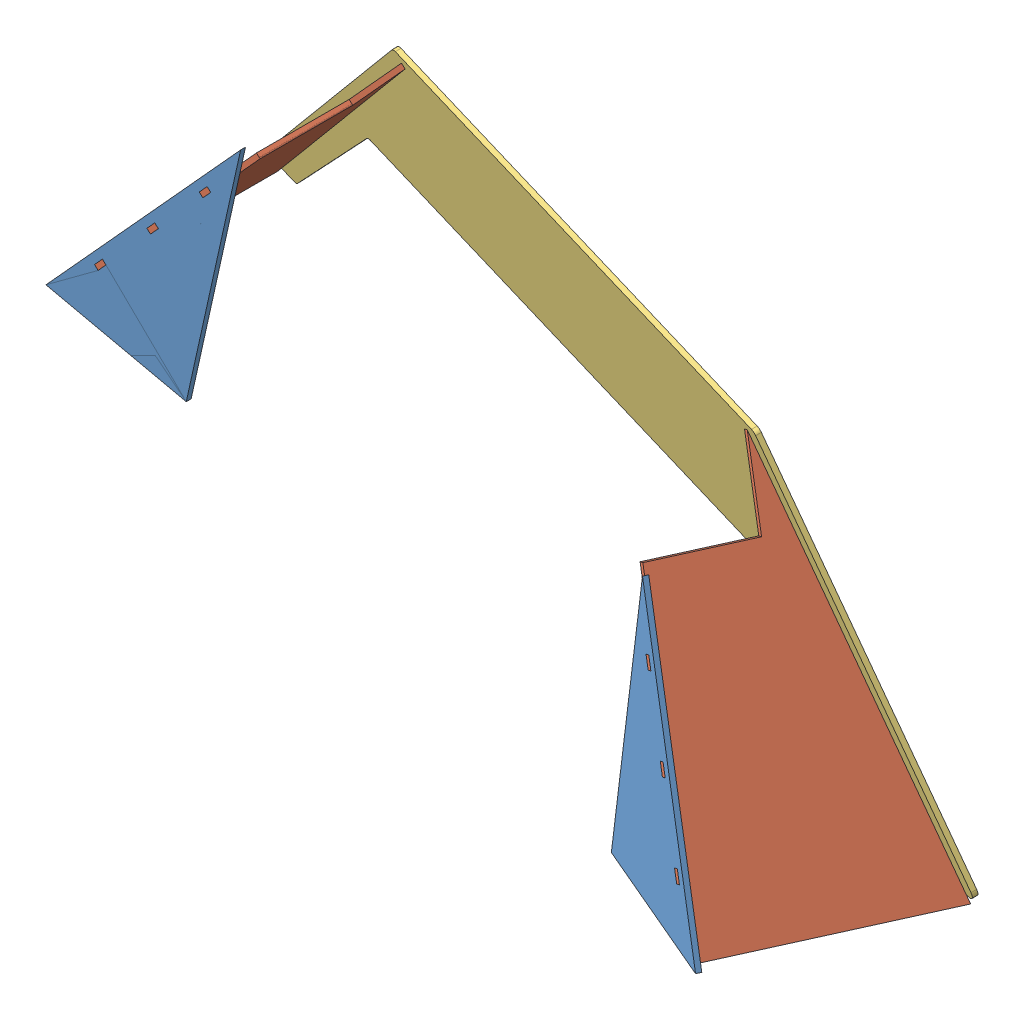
SolidWorks assembly 装配体.SLDASM, configuration Default (file format 10000). Lengths in mm.
Overall size (472.43 248.2 197.37).
7 component instances, 3 part files, 12 mates.
Components (placement in the parent):
- 三角面wzh-1: 三角面wzh.SLDPRT [默认] at (75.9658 122.0827 75.8386) x (0.095087 -0.995469 0) z (0 0 -1) size (122.75 110.01 2.5)
- 梯形碳纤维wzh-1: 梯形碳纤维wzh.SLDPRT [默认] at (30.0589 50.5452 39.0196) x (0 0 1) z (-0.73994 0.672673 0) size (112.5 190 2.5)
- 后板1-1: 后板1.SLDPRT [Default] at (667.1296 104.5885 134.2495) x (0.971826 -0.155867 0.176805) z (0.209877 0.230864 -0.950081) size (454.59 164.79 2.5)
- 三角面wzh-2: 三角面wzh.SLDPRT [默认] at (75.9657 122.0828 75.8386) x (0.095087 -0.995469 0) z (0 0 -1) size (122.75 110.01 2.5)
- 梯形碳纤维wzh-2: 梯形碳纤维wzh.SLDPRT [默认] at (30.0587 50.5453 39.0196) x (0 0 1) z (-0.73994 0.672673 0) size (112.5 190 2.5)
- 梯形碳纤维wzh-3: 梯形碳纤维wzh.SLDPRT [默认] at (385.308 -5.0467 103.9871) x (-0.343648 0.055116 0.93748) z (-0.861513 -0.415822 -0.291354) size (112.5 190 2.5)
- 三角面wzh-3: 三角面wzh.SLDPRT [默认] at (352.2266 77.7744 123.5991) x (-0.3861 -0.918293 -0.087543) z (-0.343648 0.055116 0.93748) size (122.75 110.01 2.5)
Mates (geometry in assembly coordinates):
- 平行2: parallel aligned: plane of 梯形碳纤维wzh-1 through (28.209 52.2269 39.0196) normal (-0.73994 0.672673 0); plane of 后板1-1 through (117.1921 159.0279 23.3631) normal (-0.73994 0.672673 0)
- 重合9: coincident anti-aligned: plane of 梯形碳纤维wzh-1 through (1.7793 23.1542 26.1167) normal (-0.639093 -0.703003 -0.312004); plane of 后板1-1 through (13.9956 36.5921 -29.1846) normal (0.639093 0.703003 0.312004)
- 重合10: coincident aligned: plane of 梯形碳纤维wzh-1 through (40.4253 65.6648 -16.2817) normal (0.209877 0.230864 -0.950081); plane of 后板1-1 through (667.6543 105.1656 131.8743) normal (0.209877 0.230864 -0.950081)
- 重合11: coincident anti-aligned: plane of 梯形碳纤维wzh-1 through (28.209 52.2269 39.0196) normal (-0.73994 0.672673 0); plane of 后板1-1 through (13.9956 36.5921 -29.1846) normal (0.73994 -0.672673 0)
- 重合14: coincident: line of 三角面wzh-1 through (73.1706 97.9681 75.8386) axis (-0.672673 -0.73994 0); moEndPointRef_w of 梯形碳纤维wzh-1
- 重合15: coincident anti-aligned: plane of 三角面wzh-1 through (71.3208 99.6498 73.3386) normal (-0.672673 -0.73994 0); plane of 梯形碳纤维wzh-1 through (71.3208 99.6498 39.0196) normal (0.672673 0.73994 0)
- 重合17: coincident: line of 三角面wzh-2 through (73.1705 97.9683 75.8386) axis (-0.672673 -0.73994 0); moEndPointRef_w of 梯形碳纤维wzh-2
- 重合18: coincident anti-aligned: plane of 三角面wzh-2 through (71.3206 99.65 73.3386) normal (-0.672673 -0.73994 0); plane of 梯形碳纤维wzh-2 through (71.3206 99.65 39.0196) normal (0.672673 0.73994 0)
- 重合26: coincident aligned: line of 后板1-1 through (356.098 82.074 57.439) axis (-0.462328 0.879655 0.111621); line of 梯形碳纤维wzh-3 through (356.0964 82.0769 57.4394) axis (-0.462328 0.879655 0.111621)
- 重合28: coincident anti-aligned: line of 后板1-1 through (416.6438 -27.9869 44.0697) axis (-0.861513 -0.415822 -0.291354); line of 梯形碳纤维wzh-3 through (414.49 -29.0265 43.3413) axis (0.861513 0.415822 0.291354)
- 重合29: coincident aligned: line of 梯形碳纤维wzh-3 through (346.5466 54.1225 125.5743) axis (0.373767 -0.907774 0.19038); line of 三角面wzh-3 through (346.5466 54.1225 125.5743) axis (0.373767 -0.907774 0.19038)
- 重合30: coincident aligned: line of 梯形碳纤维wzh-3 through (378.6905 -23.9461 141.947) axis (0.861513 0.415822 0.291354); line of 三角面wzh-3 through (378.6905 -23.9461 141.947) axis (0.861513 0.415822 0.291354)
